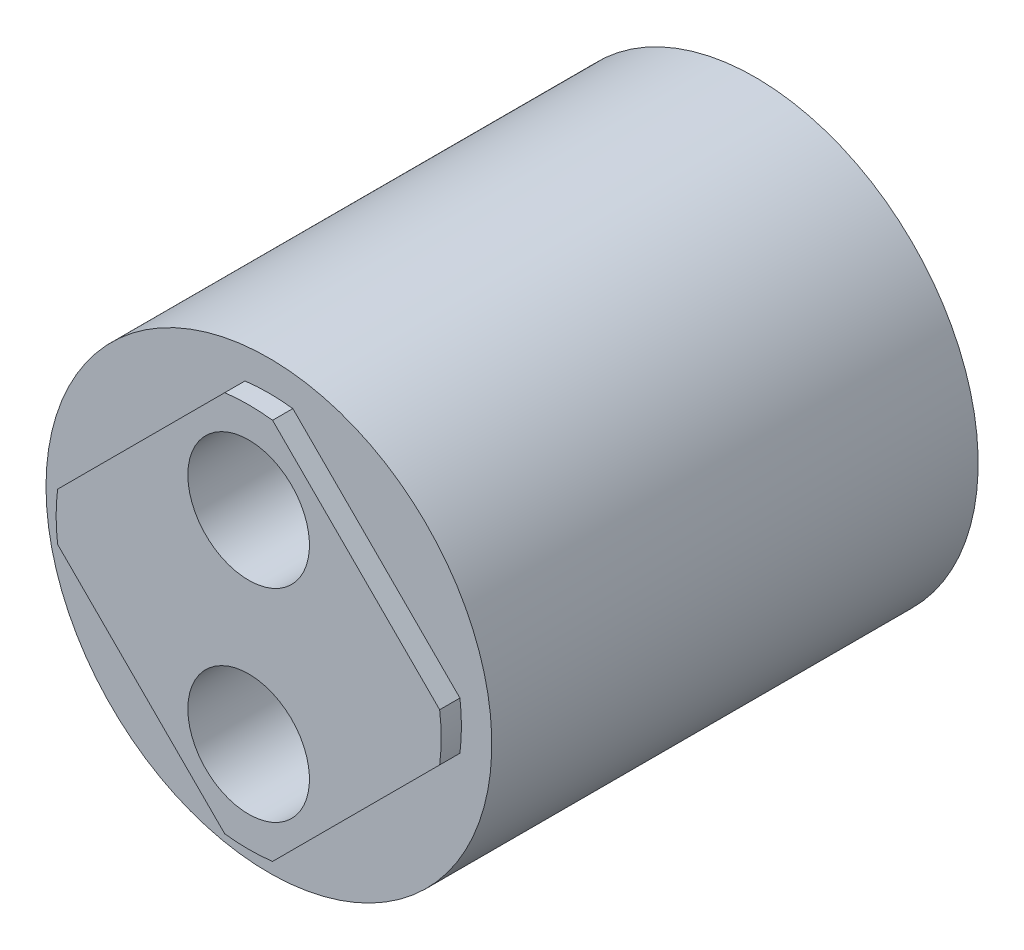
ISO-10303-21;
HEADER;
FILE_DESCRIPTION(('STEP AP214'),'2;1');
FILE_NAME('part.step','',(''),(''),'','','');
FILE_SCHEMA(('AUTOMOTIVE_DESIGN { 1 0 10303 214 1 1 1 1 }'));
ENDSEC;
DATA;
#1=APPLICATION_CONTEXT('core data for automotive mechanical design processes');
#2=APPLICATION_PROTOCOL_DEFINITION('international standard','automotive_design',2000,#1);
#3=PRODUCT_CONTEXT('',#1,'mechanical');
#4=PRODUCT('Part','Part','',(#3));
#5=PRODUCT_RELATED_PRODUCT_CATEGORY('part','',(#4));
#6=PRODUCT_DEFINITION_FORMATION('','',#4);
#7=PRODUCT_DEFINITION_CONTEXT('part definition',#1,'design');
#8=PRODUCT_DEFINITION('design','',#6,#7);
#9=PRODUCT_DEFINITION_SHAPE('','',#8);
#10=(LENGTH_UNIT() NAMED_UNIT(*) SI_UNIT(.MILLI.,.METRE.));
#11=(NAMED_UNIT(*) PLANE_ANGLE_UNIT() SI_UNIT($,.RADIAN.));
#12=(NAMED_UNIT(*) SI_UNIT($,.STERADIAN.) SOLID_ANGLE_UNIT());
#13=UNCERTAINTY_MEASURE_WITH_UNIT(LENGTH_MEASURE(1.E-05),#10,'distance_accuracy_value','');
#14=(GEOMETRIC_REPRESENTATION_CONTEXT(3) GLOBAL_UNCERTAINTY_ASSIGNED_CONTEXT((#13)) GLOBAL_UNIT_ASSIGNED_CONTEXT((#10,
#11,#12)) REPRESENTATION_CONTEXT('',''));
#15=CARTESIAN_POINT('',(0.,0.,0.));
#16=DIRECTION('',(0.,0.,1.));
#17=DIRECTION('',(1.,0.,0.));
#18=AXIS2_PLACEMENT_3D('',#15,#16,#17);
#19=CARTESIAN_POINT('',(0.,0.,25.));
#20=DIRECTION('',(0.,0.,-1.));
#21=DIRECTION('',(1.,0.,0.));
#22=AXIS2_PLACEMENT_3D('',#19,#20,#21);
#23=CYLINDRICAL_SURFACE('',#22,9.5);
#24=CARTESIAN_POINT('',(0.,0.,25.));
#25=DIRECTION('',(0.,0.,1.));
#26=DIRECTION('',(-1.,0.,0.));
#27=AXIS2_PLACEMENT_3D('',#24,#25,#26);
#28=CIRCLE('',#27,9.5);
#29=CARTESIAN_POINT('',(9.42640648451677,-1.18019523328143,25.));
#30=VERTEX_POINT('',#29);
#31=CARTESIAN_POINT('',(9.42640648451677,1.18019523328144,25.));
#32=VERTEX_POINT('',#31);
#33=EDGE_CURVE('E115',#30,#32,#28,.T.);
#34=ORIENTED_EDGE('',*,*,#33,.F.);
#35=DIRECTION('',(0.,0.,-1.));
#36=VECTOR('',#35,1.);
#37=CARTESIAN_POINT('',(9.42640648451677,-1.18019523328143,25.));
#38=LINE('',#37,#36);
#39=CARTESIAN_POINT('',(9.42640648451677,-1.18019523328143,24.));
#40=VERTEX_POINT('',#39);
#41=EDGE_CURVE('E128',#30,#40,#38,.T.);
#42=ORIENTED_EDGE('',*,*,#41,.T.);
#43=CARTESIAN_POINT('',(0.,0.,24.));
#44=DIRECTION('',(0.,0.,1.));
#45=DIRECTION('',(-1.,0.,0.));
#46=AXIS2_PLACEMENT_3D('',#43,#44,#45);
#47=CIRCLE('',#46,9.5);
#48=CARTESIAN_POINT('',(9.42640648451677,1.18019523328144,24.));
#49=VERTEX_POINT('',#48);
#50=EDGE_CURVE('E9',#40,#49,#47,.T.);
#51=ORIENTED_EDGE('',*,*,#50,.T.);
#52=DIRECTION('',(0.,0.,-1.));
#53=VECTOR('',#52,1.);
#54=CARTESIAN_POINT('',(9.42640648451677,1.18019523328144,25.));
#55=LINE('',#54,#53);
#56=EDGE_CURVE('E40',#32,#49,#55,.T.);
#57=ORIENTED_EDGE('',*,*,#56,.F.);
#58=EDGE_LOOP('',(#34,#42,#51,#57));
#59=FACE_BOUND('',#58,.T.);
#60=ADVANCED_FACE('F14',(#59),#23,.T.);
#61=CARTESIAN_POINT('',(0.,-5.,24.));
#62=DIRECTION('',(0.,0.,-1.));
#63=DIRECTION('',(1.,0.,0.));
#64=AXIS2_PLACEMENT_3D('',#61,#62,#63);
#65=CYLINDRICAL_SURFACE('',#64,3.);
#66=CARTESIAN_POINT('',(0.,-5.,10.));
#67=DIRECTION('',(0.,0.,1.));
#68=DIRECTION('',(-1.,0.,0.));
#69=AXIS2_PLACEMENT_3D('',#66,#67,#68);
#70=CIRCLE('',#69,3.);
#71=CARTESIAN_POINT('',(-3.,-5.,10.));
#72=VERTEX_POINT('',#71);
#73=EDGE_CURVE('E220',#72,#72,#70,.F.);
#74=ORIENTED_EDGE('',*,*,#73,.T.);
#75=EDGE_LOOP('',(#74));
#76=FACE_BOUND('',#75,.T.);
#77=CARTESIAN_POINT('',(0.,-5.,25.));
#78=DIRECTION('',(0.,0.,1.));
#79=DIRECTION('',(-1.,0.,0.));
#80=AXIS2_PLACEMENT_3D('',#77,#78,#79);
#81=CIRCLE('',#80,3.);
#82=CARTESIAN_POINT('',(-3.,-5.,25.));
#83=VERTEX_POINT('',#82);
#84=EDGE_CURVE('E25',#83,#83,#81,.T.);
#85=ORIENTED_EDGE('',*,*,#84,.T.);
#86=EDGE_LOOP('',(#85));
#87=FACE_BOUND('',#86,.T.);
#88=ADVANCED_FACE('F246',(#76,#87),#65,.F.);
#89=CARTESIAN_POINT('',(0.,5.,24.));
#90=DIRECTION('',(0.,0.,-1.));
#91=DIRECTION('',(1.,0.,0.));
#92=AXIS2_PLACEMENT_3D('',#89,#90,#91);
#93=CYLINDRICAL_SURFACE('',#92,3.);
#94=CARTESIAN_POINT('',(0.,5.,10.));
#95=DIRECTION('',(0.,0.,1.));
#96=DIRECTION('',(-1.,0.,0.));
#97=AXIS2_PLACEMENT_3D('',#94,#95,#96);
#98=CIRCLE('',#97,3.);
#99=CARTESIAN_POINT('',(-3.,5.,10.));
#100=VERTEX_POINT('',#99);
#101=EDGE_CURVE('E223',#100,#100,#98,.F.);
#102=ORIENTED_EDGE('',*,*,#101,.T.);
#103=EDGE_LOOP('',(#102));
#104=FACE_BOUND('',#103,.T.);
#105=CARTESIAN_POINT('',(0.,5.,25.));
#106=DIRECTION('',(0.,0.,1.));
#107=DIRECTION('',(-1.,0.,0.));
#108=AXIS2_PLACEMENT_3D('',#105,#106,#107);
#109=CIRCLE('',#108,3.);
#110=CARTESIAN_POINT('',(-3.,5.,25.));
#111=VERTEX_POINT('',#110);
#112=EDGE_CURVE('E158',#111,#111,#109,.T.);
#113=ORIENTED_EDGE('',*,*,#112,.T.);
#114=EDGE_LOOP('',(#113));
#115=FACE_BOUND('',#114,.T.);
#116=ADVANCED_FACE('F227',(#104,#115),#93,.F.);
#117=CARTESIAN_POINT('',(0.,0.,24.));
#118=DIRECTION('',(0.,0.,-1.));
#119=DIRECTION('',(1.,0.,0.));
#120=AXIS2_PLACEMENT_3D('',#117,#118,#119);
#121=CYLINDRICAL_SURFACE('',#120,11.);
#122=CARTESIAN_POINT('',(0.,0.,24.));
#123=DIRECTION('',(0.,0.,1.));
#124=DIRECTION('',(-1.,0.,0.));
#125=AXIS2_PLACEMENT_3D('',#122,#123,#124);
#126=CIRCLE('',#125,11.);
#127=CARTESIAN_POINT('',(-11.,0.,24.));
#128=VERTEX_POINT('',#127);
#129=EDGE_CURVE('E162',#128,#128,#126,.T.);
#130=ORIENTED_EDGE('',*,*,#129,.F.);
#131=EDGE_LOOP('',(#130));
#132=FACE_BOUND('',#131,.T.);
#133=CARTESIAN_POINT('',(0.,0.,0.));
#134=DIRECTION('',(0.,0.,1.));
#135=DIRECTION('',(-1.,0.,0.));
#136=AXIS2_PLACEMENT_3D('',#133,#134,#135);
#137=CIRCLE('',#136,11.);
#138=CARTESIAN_POINT('',(-11.,0.,0.));
#139=VERTEX_POINT('',#138);
#140=EDGE_CURVE('E18',#139,#139,#137,.F.);
#141=ORIENTED_EDGE('',*,*,#140,.F.);
#142=EDGE_LOOP('',(#141));
#143=FACE_BOUND('',#142,.T.);
#144=ADVANCED_FACE('F286',(#132,#143),#121,.T.);
#145=CARTESIAN_POINT('',(0.,0.,24.));
#146=DIRECTION('',(0.,0.,1.));
#147=DIRECTION('',(0.,-1.,0.));
#148=AXIS2_PLACEMENT_3D('',#145,#146,#147);
#149=PLANE('',#148);
#150=ORIENTED_EDGE('',*,*,#129,.T.);
#151=EDGE_LOOP('',(#150));
#152=FACE_BOUND('',#151,.T.);
#153=DIRECTION('',(-0.707106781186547,-0.707106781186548,0.));
#154=VECTOR('',#153,1.);
#155=CARTESIAN_POINT('',(-1.18019523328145,9.42640648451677,24.));
#156=LINE('',#155,#154);
#157=CARTESIAN_POINT('',(-1.18019523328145,9.42640648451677,24.));
#158=VERTEX_POINT('',#157);
#159=CARTESIAN_POINT('',(-9.42640648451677,1.18019523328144,24.));
#160=VERTEX_POINT('',#159);
#161=EDGE_CURVE('E186',#158,#160,#156,.T.);
#162=ORIENTED_EDGE('',*,*,#161,.F.);
#163=CARTESIAN_POINT('',(0.,0.,24.));
#164=DIRECTION('',(0.,0.,1.));
#165=DIRECTION('',(-1.,0.,0.));
#166=AXIS2_PLACEMENT_3D('',#163,#164,#165);
#167=CIRCLE('',#166,9.5);
#168=CARTESIAN_POINT('',(1.18019523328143,9.42640648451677,24.));
#169=VERTEX_POINT('',#168);
#170=EDGE_CURVE('E165',#169,#158,#167,.T.);
#171=ORIENTED_EDGE('',*,*,#170,.F.);
#172=DIRECTION('',(-0.707106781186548,0.707106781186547,0.));
#173=VECTOR('',#172,1.);
#174=CARTESIAN_POINT('',(9.42640648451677,1.18019523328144,24.));
#175=LINE('',#174,#173);
#176=EDGE_CURVE('E155',#49,#169,#175,.T.);
#177=ORIENTED_EDGE('',*,*,#176,.F.);
#178=ORIENTED_EDGE('',*,*,#50,.F.);
#179=DIRECTION('',(0.707106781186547,0.707106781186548,0.));
#180=VECTOR('',#179,1.);
#181=CARTESIAN_POINT('',(1.18019523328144,-9.42640648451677,24.));
#182=LINE('',#181,#180);
#183=CARTESIAN_POINT('',(1.18019523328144,-9.42640648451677,24.));
#184=VERTEX_POINT('',#183);
#185=EDGE_CURVE('E146',#184,#40,#182,.T.);
#186=ORIENTED_EDGE('',*,*,#185,.F.);
#187=CARTESIAN_POINT('',(0.,0.,24.));
#188=DIRECTION('',(0.,0.,1.));
#189=DIRECTION('',(-1.,0.,0.));
#190=AXIS2_PLACEMENT_3D('',#187,#188,#189);
#191=CIRCLE('',#190,9.5);
#192=CARTESIAN_POINT('',(-1.18019523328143,-9.42640648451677,24.));
#193=VERTEX_POINT('',#192);
#194=EDGE_CURVE('E144',#193,#184,#191,.T.);
#195=ORIENTED_EDGE('',*,*,#194,.F.);
#196=DIRECTION('',(0.707106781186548,-0.707106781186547,0.));
#197=VECTOR('',#196,1.);
#198=CARTESIAN_POINT('',(-9.42640648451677,-1.18019523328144,24.));
#199=LINE('',#198,#197);
#200=CARTESIAN_POINT('',(-9.42640648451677,-1.18019523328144,24.));
#201=VERTEX_POINT('',#200);
#202=EDGE_CURVE('E69',#201,#193,#199,.T.);
#203=ORIENTED_EDGE('',*,*,#202,.F.);
#204=CARTESIAN_POINT('',(0.,0.,24.));
#205=DIRECTION('',(0.,0.,1.));
#206=DIRECTION('',(-1.,0.,0.));
#207=AXIS2_PLACEMENT_3D('',#204,#205,#206);
#208=CIRCLE('',#207,9.5);
#209=EDGE_CURVE('E78',#160,#201,#208,.T.);
#210=ORIENTED_EDGE('',*,*,#209,.F.);
#211=EDGE_LOOP('',(#162,#171,#177,#178,#186,#195,#203,#210));
#212=FACE_BOUND('',#211,.T.);
#213=ADVANCED_FACE('F259',(#152,#212),#149,.T.);
#214=CARTESIAN_POINT('',(0.,0.,25.));
#215=DIRECTION('',(0.,0.,1.));
#216=DIRECTION('',(0.,-1.,0.));
#217=AXIS2_PLACEMENT_3D('',#214,#215,#216);
#218=PLANE('',#217);
#219=CARTESIAN_POINT('',(0.,0.,25.));
#220=DIRECTION('',(0.,0.,1.));
#221=DIRECTION('',(-1.,0.,0.));
#222=AXIS2_PLACEMENT_3D('',#219,#220,#221);
#223=CIRCLE('',#222,9.5);
#224=CARTESIAN_POINT('',(1.18019523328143,9.42640648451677,25.));
#225=VERTEX_POINT('',#224);
#226=CARTESIAN_POINT('',(-1.18019523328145,9.42640648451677,25.));
#227=VERTEX_POINT('',#226);
#228=EDGE_CURVE('E176',#225,#227,#223,.T.);
#229=ORIENTED_EDGE('',*,*,#228,.T.);
#230=DIRECTION('',(-0.707106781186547,-0.707106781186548,0.));
#231=VECTOR('',#230,1.);
#232=CARTESIAN_POINT('',(-1.18019523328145,9.42640648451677,25.));
#233=LINE('',#232,#231);
#234=CARTESIAN_POINT('',(-9.42640648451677,1.18019523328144,25.));
#235=VERTEX_POINT('',#234);
#236=EDGE_CURVE('E172',#227,#235,#233,.T.);
#237=ORIENTED_EDGE('',*,*,#236,.T.);
#238=CARTESIAN_POINT('',(0.,0.,25.));
#239=DIRECTION('',(0.,0.,1.));
#240=DIRECTION('',(-1.,0.,0.));
#241=AXIS2_PLACEMENT_3D('',#238,#239,#240);
#242=CIRCLE('',#241,9.5);
#243=CARTESIAN_POINT('',(-9.42640648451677,-1.18019523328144,25.));
#244=VERTEX_POINT('',#243);
#245=EDGE_CURVE('E177',#235,#244,#242,.T.);
#246=ORIENTED_EDGE('',*,*,#245,.T.);
#247=DIRECTION('',(0.707106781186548,-0.707106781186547,0.));
#248=VECTOR('',#247,1.);
#249=CARTESIAN_POINT('',(-9.42640648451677,-1.18019523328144,25.));
#250=LINE('',#249,#248);
#251=CARTESIAN_POINT('',(-1.18019523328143,-9.42640648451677,25.));
#252=VERTEX_POINT('',#251);
#253=EDGE_CURVE('E136',#244,#252,#250,.T.);
#254=ORIENTED_EDGE('',*,*,#253,.T.);
#255=CARTESIAN_POINT('',(0.,0.,25.));
#256=DIRECTION('',(0.,0.,1.));
#257=DIRECTION('',(-1.,0.,0.));
#258=AXIS2_PLACEMENT_3D('',#255,#256,#257);
#259=CIRCLE('',#258,9.5);
#260=CARTESIAN_POINT('',(1.18019523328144,-9.42640648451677,25.));
#261=VERTEX_POINT('',#260);
#262=EDGE_CURVE('E130',#252,#261,#259,.T.);
#263=ORIENTED_EDGE('',*,*,#262,.T.);
#264=DIRECTION('',(0.707106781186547,0.707106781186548,0.));
#265=VECTOR('',#264,1.);
#266=CARTESIAN_POINT('',(1.18019523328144,-9.42640648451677,25.));
#267=LINE('',#266,#265);
#268=EDGE_CURVE('E123',#261,#30,#267,.T.);
#269=ORIENTED_EDGE('',*,*,#268,.T.);
#270=ORIENTED_EDGE('',*,*,#33,.T.);
#271=DIRECTION('',(-0.707106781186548,0.707106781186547,0.));
#272=VECTOR('',#271,1.);
#273=CARTESIAN_POINT('',(9.42640648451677,1.18019523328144,25.));
#274=LINE('',#273,#272);
#275=EDGE_CURVE('E107',#32,#225,#274,.T.);
#276=ORIENTED_EDGE('',*,*,#275,.T.);
#277=EDGE_LOOP('',(#229,#237,#246,#254,#263,#269,#270,#276));
#278=FACE_BOUND('',#277,.T.);
#279=ORIENTED_EDGE('',*,*,#112,.F.);
#280=EDGE_LOOP('',(#279));
#281=FACE_BOUND('',#280,.T.);
#282=ORIENTED_EDGE('',*,*,#84,.F.);
#283=EDGE_LOOP('',(#282));
#284=FACE_BOUND('',#283,.T.);
#285=ADVANCED_FACE('F133',(#278,#281,#284),#218,.T.);
#286=CARTESIAN_POINT('',(0.,0.,25.));
#287=DIRECTION('',(0.,0.,-1.));
#288=DIRECTION('',(1.,0.,0.));
#289=AXIS2_PLACEMENT_3D('',#286,#287,#288);
#290=CYLINDRICAL_SURFACE('',#289,9.5);
#291=ORIENTED_EDGE('',*,*,#170,.T.);
#292=DIRECTION('',(0.,0.,-1.));
#293=VECTOR('',#292,1.);
#294=CARTESIAN_POINT('',(-1.18019523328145,9.42640648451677,25.));
#295=LINE('',#294,#293);
#296=EDGE_CURVE('E182',#227,#158,#295,.T.);
#297=ORIENTED_EDGE('',*,*,#296,.F.);
#298=ORIENTED_EDGE('',*,*,#228,.F.);
#299=DIRECTION('',(0.,0.,-1.));
#300=VECTOR('',#299,1.);
#301=CARTESIAN_POINT('',(1.18019523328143,9.42640648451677,25.));
#302=LINE('',#301,#300);
#303=EDGE_CURVE('E189',#225,#169,#302,.T.);
#304=ORIENTED_EDGE('',*,*,#303,.T.);
#305=EDGE_LOOP('',(#291,#297,#298,#304));
#306=FACE_BOUND('',#305,.T.);
#307=ADVANCED_FACE('F258',(#306),#290,.T.);
#308=CARTESIAN_POINT('',(-1.18019523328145,9.42640648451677,25.));
#309=DIRECTION('',(0.707106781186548,-0.707106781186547,0.));
#310=DIRECTION('',(0.,0.,-1.));
#311=AXIS2_PLACEMENT_3D('',#308,#309,#310);
#312=PLANE('',#311);
#313=ORIENTED_EDGE('',*,*,#161,.T.);
#314=DIRECTION('',(0.,0.,-1.));
#315=VECTOR('',#314,1.);
#316=CARTESIAN_POINT('',(-9.42640648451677,1.18019523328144,25.));
#317=LINE('',#316,#315);
#318=EDGE_CURVE('E190',#235,#160,#317,.T.);
#319=ORIENTED_EDGE('',*,*,#318,.F.);
#320=ORIENTED_EDGE('',*,*,#236,.F.);
#321=ORIENTED_EDGE('',*,*,#296,.T.);
#322=EDGE_LOOP('',(#313,#319,#320,#321));
#323=FACE_BOUND('',#322,.T.);
#324=ADVANCED_FACE('F260',(#323),#312,.F.);
#325=CARTESIAN_POINT('',(0.,0.,25.));
#326=DIRECTION('',(0.,0.,-1.));
#327=DIRECTION('',(1.,0.,0.));
#328=AXIS2_PLACEMENT_3D('',#325,#326,#327);
#329=CYLINDRICAL_SURFACE('',#328,9.5);
#330=ORIENTED_EDGE('',*,*,#209,.T.);
#331=DIRECTION('',(0.,0.,-1.));
#332=VECTOR('',#331,1.);
#333=CARTESIAN_POINT('',(-9.42640648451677,-1.18019523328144,25.));
#334=LINE('',#333,#332);
#335=EDGE_CURVE('E168',#244,#201,#334,.T.);
#336=ORIENTED_EDGE('',*,*,#335,.F.);
#337=ORIENTED_EDGE('',*,*,#245,.F.);
#338=ORIENTED_EDGE('',*,*,#318,.T.);
#339=EDGE_LOOP('',(#330,#336,#337,#338));
#340=FACE_BOUND('',#339,.T.);
#341=ADVANCED_FACE('F262',(#340),#329,.T.);
#342=CARTESIAN_POINT('',(-9.42640648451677,-1.18019523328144,25.));
#343=DIRECTION('',(0.707106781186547,0.707106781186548,0.));
#344=DIRECTION('',(-0.707106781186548,0.707106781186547,0.));
#345=AXIS2_PLACEMENT_3D('',#342,#343,#344);
#346=PLANE('',#345);
#347=ORIENTED_EDGE('',*,*,#202,.T.);
#348=DIRECTION('',(0.,0.,-1.));
#349=VECTOR('',#348,1.);
#350=CARTESIAN_POINT('',(-1.18019523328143,-9.42640648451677,25.));
#351=LINE('',#350,#349);
#352=EDGE_CURVE('E152',#252,#193,#351,.T.);
#353=ORIENTED_EDGE('',*,*,#352,.F.);
#354=ORIENTED_EDGE('',*,*,#253,.F.);
#355=ORIENTED_EDGE('',*,*,#335,.T.);
#356=EDGE_LOOP('',(#347,#353,#354,#355));
#357=FACE_BOUND('',#356,.T.);
#358=ADVANCED_FACE('F269',(#357),#346,.F.);
#359=CARTESIAN_POINT('',(0.,0.,25.));
#360=DIRECTION('',(0.,0.,-1.));
#361=DIRECTION('',(1.,0.,0.));
#362=AXIS2_PLACEMENT_3D('',#359,#360,#361);
#363=CYLINDRICAL_SURFACE('',#362,9.5);
#364=ORIENTED_EDGE('',*,*,#194,.T.);
#365=DIRECTION('',(0.,0.,-1.));
#366=VECTOR('',#365,1.);
#367=CARTESIAN_POINT('',(1.18019523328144,-9.42640648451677,25.));
#368=LINE('',#367,#366);
#369=EDGE_CURVE('E127',#261,#184,#368,.T.);
#370=ORIENTED_EDGE('',*,*,#369,.F.);
#371=ORIENTED_EDGE('',*,*,#262,.F.);
#372=ORIENTED_EDGE('',*,*,#352,.T.);
#373=EDGE_LOOP('',(#364,#370,#371,#372));
#374=FACE_BOUND('',#373,.T.);
#375=ADVANCED_FACE('F143',(#374),#363,.T.);
#376=CARTESIAN_POINT('',(1.18019523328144,-9.42640648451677,25.));
#377=DIRECTION('',(-0.707106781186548,0.707106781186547,0.));
#378=DIRECTION('',(0.,0.,1.));
#379=AXIS2_PLACEMENT_3D('',#376,#377,#378);
#380=PLANE('',#379);
#381=ORIENTED_EDGE('',*,*,#185,.T.);
#382=ORIENTED_EDGE('',*,*,#41,.F.);
#383=ORIENTED_EDGE('',*,*,#268,.F.);
#384=ORIENTED_EDGE('',*,*,#369,.T.);
#385=EDGE_LOOP('',(#381,#382,#383,#384));
#386=FACE_BOUND('',#385,.T.);
#387=ADVANCED_FACE('F16',(#386),#380,.F.);
#388=CARTESIAN_POINT('',(9.42640648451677,1.18019523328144,25.));
#389=DIRECTION('',(-0.707106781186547,-0.707106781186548,0.));
#390=DIRECTION('',(0.,0.,-1.));
#391=AXIS2_PLACEMENT_3D('',#388,#389,#390);
#392=PLANE('',#391);
#393=ORIENTED_EDGE('',*,*,#176,.T.);
#394=ORIENTED_EDGE('',*,*,#303,.F.);
#395=ORIENTED_EDGE('',*,*,#275,.F.);
#396=ORIENTED_EDGE('',*,*,#56,.T.);
#397=EDGE_LOOP('',(#393,#394,#395,#396));
#398=FACE_BOUND('',#397,.T.);
#399=ADVANCED_FACE('F242',(#398),#392,.F.);
#400=CARTESIAN_POINT('',(0.,0.,0.));
#401=DIRECTION('',(0.,0.,1.));
#402=DIRECTION('',(-1.,0.,0.));
#403=AXIS2_PLACEMENT_3D('',#400,#401,#402);
#404=PLANE('',#403);
#405=ORIENTED_EDGE('',*,*,#140,.T.);
#406=EDGE_LOOP('',(#405));
#407=FACE_BOUND('',#406,.T.);
#408=ADVANCED_FACE('F233',(#407),#404,.F.);
#409=CARTESIAN_POINT('',(0.,0.,10.));
#410=DIRECTION('',(0.,0.,1.));
#411=DIRECTION('',(-1.,0.,0.));
#412=AXIS2_PLACEMENT_3D('',#409,#410,#411);
#413=PLANE('',#412);
#414=ORIENTED_EDGE('',*,*,#101,.F.);
#415=EDGE_LOOP('',(#414));
#416=FACE_BOUND('',#415,.T.);
#417=ADVANCED_FACE('F230',(#416),#413,.T.);
#418=ORIENTED_EDGE('',*,*,#73,.F.);
#419=EDGE_LOOP('',(#418));
#420=FACE_BOUND('',#419,.T.);
#421=ADVANCED_FACE('F232',(#420),#413,.T.);
#422=CLOSED_SHELL('',(#60,#88,#116,#144,#213,#285,#307,#324,#341,#358,#375,#387,#399,#408,#417,#421));
#423=MANIFOLD_SOLID_BREP('B1',#422);
#424=ADVANCED_BREP_SHAPE_REPRESENTATION('',(#18,#423),#14);
#425=SHAPE_DEFINITION_REPRESENTATION(#9,#424);
ENDSEC;
END-ISO-10303-21;
